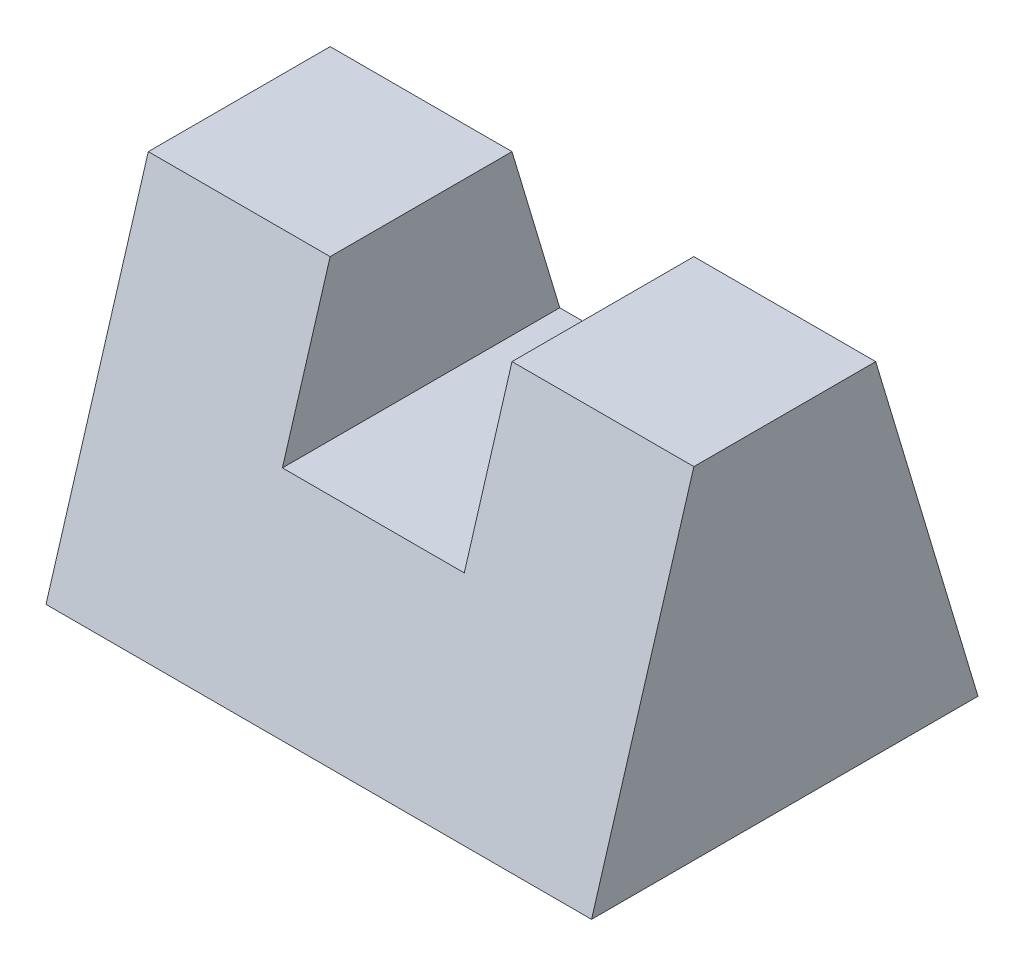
ISO-10303-21;
HEADER;
FILE_DESCRIPTION(('STEP AP214'),'2;1');
FILE_NAME('part.step','',(''),(''),'','','');
FILE_SCHEMA(('AUTOMOTIVE_DESIGN { 1 0 10303 214 1 1 1 1 }'));
ENDSEC;
DATA;
#1=APPLICATION_CONTEXT('core data for automotive mechanical design processes');
#2=APPLICATION_PROTOCOL_DEFINITION('international standard','automotive_design',2000,#1);
#3=PRODUCT_CONTEXT('',#1,'mechanical');
#4=PRODUCT('Part','Part','',(#3));
#5=PRODUCT_RELATED_PRODUCT_CATEGORY('part','',(#4));
#6=PRODUCT_DEFINITION_FORMATION('','',#4);
#7=PRODUCT_DEFINITION_CONTEXT('part definition',#1,'design');
#8=PRODUCT_DEFINITION('design','',#6,#7);
#9=PRODUCT_DEFINITION_SHAPE('','',#8);
#10=(LENGTH_UNIT() NAMED_UNIT(*) SI_UNIT(.MILLI.,.METRE.));
#11=(NAMED_UNIT(*) PLANE_ANGLE_UNIT() SI_UNIT($,.RADIAN.));
#12=(NAMED_UNIT(*) SI_UNIT($,.STERADIAN.) SOLID_ANGLE_UNIT());
#13=UNCERTAINTY_MEASURE_WITH_UNIT(LENGTH_MEASURE(1.E-05),#10,'distance_accuracy_value','');
#14=(GEOMETRIC_REPRESENTATION_CONTEXT(3) GLOBAL_UNCERTAINTY_ASSIGNED_CONTEXT((#13)) GLOBAL_UNIT_ASSIGNED_CONTEXT((#10,
#11,#12)) REPRESENTATION_CONTEXT('',''));
#15=CARTESIAN_POINT('',(0.,0.,0.));
#16=DIRECTION('',(0.,0.,1.));
#17=DIRECTION('',(1.,0.,0.));
#18=AXIS2_PLACEMENT_3D('',#15,#16,#17);
#19=CARTESIAN_POINT('',(120.,75.,-20.));
#20=DIRECTION('',(0.,-1.,0.));
#21=DIRECTION('',(0.,0.,-1.));
#22=AXIS2_PLACEMENT_3D('',#19,#20,#21);
#23=PLANE('',#22);
#24=DIRECTION('',(-1.,0.,0.));
#25=VECTOR('',#24,1.);
#26=CARTESIAN_POINT('',(120.,75.,20.));
#27=LINE('',#26,#25);
#28=CARTESIAN_POINT('',(40.,75.,20.));
#29=VERTEX_POINT('',#28);
#30=CARTESIAN_POINT('',(0.,75.,20.));
#31=VERTEX_POINT('',#30);
#32=EDGE_CURVE('E77',#29,#31,#27,.T.);
#33=ORIENTED_EDGE('',*,*,#32,.F.);
#34=DIRECTION('',(0.,0.,-1.));
#35=VECTOR('',#34,1.);
#36=CARTESIAN_POINT('',(40.,75.,-20.));
#37=LINE('',#36,#35);
#38=CARTESIAN_POINT('',(40.,75.,-20.));
#39=VERTEX_POINT('',#38);
#40=EDGE_CURVE('E39',#29,#39,#37,.T.);
#41=ORIENTED_EDGE('',*,*,#40,.T.);
#42=DIRECTION('',(-1.,0.,0.));
#43=VECTOR('',#42,1.);
#44=CARTESIAN_POINT('',(120.,75.,-20.));
#45=LINE('',#44,#43);
#46=CARTESIAN_POINT('',(0.,75.,-20.));
#47=VERTEX_POINT('',#46);
#48=EDGE_CURVE('E126',#39,#47,#45,.T.);
#49=ORIENTED_EDGE('',*,*,#48,.T.);
#50=DIRECTION('',(0.,0.,1.));
#51=VECTOR('',#50,1.);
#52=CARTESIAN_POINT('',(0.,75.,-20.));
#53=LINE('',#52,#51);
#54=EDGE_CURVE('E143',#47,#31,#53,.T.);
#55=ORIENTED_EDGE('',*,*,#54,.T.);
#56=EDGE_LOOP('',(#33,#41,#49,#55));
#57=FACE_BOUND('',#56,.T.);
#58=ADVANCED_FACE('F31',(#57),#23,.F.);
#59=CARTESIAN_POINT('',(120.,75.,20.));
#60=DIRECTION('',(0.,-0.287347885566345,-0.957826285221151));
#61=DIRECTION('',(0.,0.957826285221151,-0.287347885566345));
#62=AXIS2_PLACEMENT_3D('',#59,#60,#61);
#63=PLANE('',#62);
#64=DIRECTION('',(1.,0.,0.));
#65=VECTOR('',#64,1.);
#66=CARTESIAN_POINT('',(120.,40.,30.5));
#67=LINE('',#66,#65);
#68=CARTESIAN_POINT('',(40.,40.,30.5));
#69=VERTEX_POINT('',#68);
#70=CARTESIAN_POINT('',(80.,40.,30.5));
#71=VERTEX_POINT('',#70);
#72=EDGE_CURVE('E154',#69,#71,#67,.T.);
#73=ORIENTED_EDGE('',*,*,#72,.F.);
#74=DIRECTION('',(0.,0.957826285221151,-0.287347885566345));
#75=VECTOR('',#74,1.);
#76=CARTESIAN_POINT('',(40.,75.,20.));
#77=LINE('',#76,#75);
#78=EDGE_CURVE('E160',#69,#29,#77,.T.);
#79=ORIENTED_EDGE('',*,*,#78,.T.);
#80=ORIENTED_EDGE('',*,*,#32,.T.);
#81=DIRECTION('',(0.,-0.957826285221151,0.287347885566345));
#82=VECTOR('',#81,1.);
#83=CARTESIAN_POINT('',(0.,75.,20.));
#84=LINE('',#83,#82);
#85=CARTESIAN_POINT('',(0.,0.,42.5));
#86=VERTEX_POINT('',#85);
#87=EDGE_CURVE('E148',#31,#86,#84,.T.);
#88=ORIENTED_EDGE('',*,*,#87,.T.);
#89=DIRECTION('',(-1.,0.,0.));
#90=VECTOR('',#89,1.);
#91=CARTESIAN_POINT('',(120.,0.,42.5));
#92=LINE('',#91,#90);
#93=CARTESIAN_POINT('',(120.,0.,42.5));
#94=VERTEX_POINT('',#93);
#95=EDGE_CURVE('E112',#94,#86,#92,.T.);
#96=ORIENTED_EDGE('',*,*,#95,.F.);
#97=DIRECTION('',(0.,-0.957826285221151,0.287347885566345));
#98=VECTOR('',#97,1.);
#99=CARTESIAN_POINT('',(120.,75.,20.));
#100=LINE('',#99,#98);
#101=CARTESIAN_POINT('',(120.,75.,20.));
#102=VERTEX_POINT('',#101);
#103=EDGE_CURVE('E149',#102,#94,#100,.T.);
#104=ORIENTED_EDGE('',*,*,#103,.F.);
#105=CARTESIAN_POINT('',(80.,75.,20.));
#106=VERTEX_POINT('',#105);
#107=EDGE_CURVE('E130',#102,#106,#27,.T.);
#108=ORIENTED_EDGE('',*,*,#107,.T.);
#109=DIRECTION('',(0.,-0.957826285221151,0.287347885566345));
#110=VECTOR('',#109,1.);
#111=CARTESIAN_POINT('',(80.,75.,20.));
#112=LINE('',#111,#110);
#113=EDGE_CURVE('E46',#106,#71,#112,.T.);
#114=ORIENTED_EDGE('',*,*,#113,.T.);
#115=EDGE_LOOP('',(#73,#79,#80,#88,#96,#104,#108,#114));
#116=FACE_BOUND('',#115,.T.);
#117=ADVANCED_FACE('F33',(#116),#63,.F.);
#118=CARTESIAN_POINT('',(120.,0.,42.5));
#119=DIRECTION('',(0.,1.,0.));
#120=DIRECTION('',(0.,0.,1.));
#121=AXIS2_PLACEMENT_3D('',#118,#119,#120);
#122=PLANE('',#121);
#123=DIRECTION('',(0.,0.,-1.));
#124=VECTOR('',#123,1.);
#125=CARTESIAN_POINT('',(0.,0.,42.5));
#126=LINE('',#125,#124);
#127=CARTESIAN_POINT('',(0.,0.,-42.5));
#128=VERTEX_POINT('',#127);
#129=EDGE_CURVE('E144',#86,#128,#126,.T.);
#130=ORIENTED_EDGE('',*,*,#129,.T.);
#131=DIRECTION('',(-1.,0.,0.));
#132=VECTOR('',#131,1.);
#133=CARTESIAN_POINT('',(120.,0.,-42.5));
#134=LINE('',#133,#132);
#135=CARTESIAN_POINT('',(120.,0.,-42.5));
#136=VERTEX_POINT('',#135);
#137=EDGE_CURVE('E125',#136,#128,#134,.T.);
#138=ORIENTED_EDGE('',*,*,#137,.F.);
#139=DIRECTION('',(0.,0.,-1.));
#140=VECTOR('',#139,1.);
#141=CARTESIAN_POINT('',(120.,0.,42.5));
#142=LINE('',#141,#140);
#143=EDGE_CURVE('E85',#94,#136,#142,.T.);
#144=ORIENTED_EDGE('',*,*,#143,.F.);
#145=ORIENTED_EDGE('',*,*,#95,.T.);
#146=EDGE_LOOP('',(#130,#138,#144,#145));
#147=FACE_BOUND('',#146,.T.);
#148=ADVANCED_FACE('F174',(#147),#122,.F.);
#149=CARTESIAN_POINT('',(120.,0.,-42.5));
#150=DIRECTION('',(0.,-0.287347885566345,0.957826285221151));
#151=DIRECTION('',(0.,-0.957826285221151,-0.287347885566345));
#152=AXIS2_PLACEMENT_3D('',#149,#150,#151);
#153=PLANE('',#152);
#154=ORIENTED_EDGE('',*,*,#48,.F.);
#155=DIRECTION('',(0.,-0.957826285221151,-0.287347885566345));
#156=VECTOR('',#155,1.);
#157=CARTESIAN_POINT('',(40.,0.,-42.5));
#158=LINE('',#157,#156);
#159=CARTESIAN_POINT('',(40.,40.,-30.5));
#160=VERTEX_POINT('',#159);
#161=EDGE_CURVE('E138',#39,#160,#158,.T.);
#162=ORIENTED_EDGE('',*,*,#161,.T.);
#163=DIRECTION('',(-1.,0.,0.));
#164=VECTOR('',#163,1.);
#165=CARTESIAN_POINT('',(120.,40.,-30.5));
#166=LINE('',#165,#164);
#167=CARTESIAN_POINT('',(80.,40.,-30.5));
#168=VERTEX_POINT('',#167);
#169=EDGE_CURVE('E11',#168,#160,#166,.T.);
#170=ORIENTED_EDGE('',*,*,#169,.F.);
#171=DIRECTION('',(0.,0.957826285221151,0.287347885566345));
#172=VECTOR('',#171,1.);
#173=CARTESIAN_POINT('',(80.,0.,-42.5));
#174=LINE('',#173,#172);
#175=CARTESIAN_POINT('',(80.,75.,-20.));
#176=VERTEX_POINT('',#175);
#177=EDGE_CURVE('E107',#168,#176,#174,.T.);
#178=ORIENTED_EDGE('',*,*,#177,.T.);
#179=CARTESIAN_POINT('',(120.,75.,-20.));
#180=VERTEX_POINT('',#179);
#181=EDGE_CURVE('E120',#180,#176,#45,.T.);
#182=ORIENTED_EDGE('',*,*,#181,.F.);
#183=DIRECTION('',(0.,0.957826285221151,0.287347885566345));
#184=VECTOR('',#183,1.);
#185=CARTESIAN_POINT('',(120.,0.,-42.5));
#186=LINE('',#185,#184);
#187=EDGE_CURVE('E156',#136,#180,#186,.T.);
#188=ORIENTED_EDGE('',*,*,#187,.F.);
#189=ORIENTED_EDGE('',*,*,#137,.T.);
#190=DIRECTION('',(0.,0.957826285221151,0.287347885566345));
#191=VECTOR('',#190,1.);
#192=CARTESIAN_POINT('',(0.,0.,-42.5));
#193=LINE('',#192,#191);
#194=EDGE_CURVE('E140',#128,#47,#193,.T.);
#195=ORIENTED_EDGE('',*,*,#194,.T.);
#196=EDGE_LOOP('',(#154,#162,#170,#178,#182,#188,#189,#195));
#197=FACE_BOUND('',#196,.T.);
#198=ADVANCED_FACE('F118',(#197),#153,.F.);
#199=ORIENTED_EDGE('',*,*,#181,.T.);
#200=DIRECTION('',(0.,0.,1.));
#201=VECTOR('',#200,1.);
#202=CARTESIAN_POINT('',(80.,75.,-20.));
#203=LINE('',#202,#201);
#204=EDGE_CURVE('E104',#176,#106,#203,.T.);
#205=ORIENTED_EDGE('',*,*,#204,.T.);
#206=ORIENTED_EDGE('',*,*,#107,.F.);
#207=DIRECTION('',(0.,0.,1.));
#208=VECTOR('',#207,1.);
#209=CARTESIAN_POINT('',(120.,75.,-20.));
#210=LINE('',#209,#208);
#211=EDGE_CURVE('E55',#180,#102,#210,.T.);
#212=ORIENTED_EDGE('',*,*,#211,.F.);
#213=EDGE_LOOP('',(#199,#205,#206,#212));
#214=FACE_BOUND('',#213,.T.);
#215=ADVANCED_FACE('F124',(#214),#23,.F.);
#216=CARTESIAN_POINT('',(120.,0.,42.5));
#217=DIRECTION('',(1.,0.,0.));
#218=DIRECTION('',(0.,0.,-1.));
#219=AXIS2_PLACEMENT_3D('',#216,#217,#218);
#220=PLANE('',#219);
#221=ORIENTED_EDGE('',*,*,#103,.T.);
#222=ORIENTED_EDGE('',*,*,#143,.T.);
#223=ORIENTED_EDGE('',*,*,#187,.T.);
#224=ORIENTED_EDGE('',*,*,#211,.T.);
#225=EDGE_LOOP('',(#221,#222,#223,#224));
#226=FACE_BOUND('',#225,.T.);
#227=ADVANCED_FACE('F173',(#226),#220,.T.);
#228=CARTESIAN_POINT('',(0.,0.,42.5));
#229=DIRECTION('',(1.,0.,0.));
#230=DIRECTION('',(0.,0.,-1.));
#231=AXIS2_PLACEMENT_3D('',#228,#229,#230);
#232=PLANE('',#231);
#233=ORIENTED_EDGE('',*,*,#87,.F.);
#234=ORIENTED_EDGE('',*,*,#54,.F.);
#235=ORIENTED_EDGE('',*,*,#194,.F.);
#236=ORIENTED_EDGE('',*,*,#129,.F.);
#237=EDGE_LOOP('',(#233,#234,#235,#236));
#238=FACE_BOUND('',#237,.T.);
#239=ADVANCED_FACE('F147',(#238),#232,.F.);
#240=CARTESIAN_POINT('',(40.,40.,39.8467432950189));
#241=DIRECTION('',(0.,1.,0.));
#242=DIRECTION('',(0.,0.,1.));
#243=AXIS2_PLACEMENT_3D('',#240,#241,#242);
#244=PLANE('',#243);
#245=ORIENTED_EDGE('',*,*,#72,.T.);
#246=DIRECTION('',(0.,0.,-1.));
#247=VECTOR('',#246,1.);
#248=CARTESIAN_POINT('',(80.,40.,-36.9731800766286));
#249=LINE('',#248,#247);
#250=EDGE_CURVE('E122',#71,#168,#249,.T.);
#251=ORIENTED_EDGE('',*,*,#250,.T.);
#252=ORIENTED_EDGE('',*,*,#169,.T.);
#253=DIRECTION('',(0.,0.,1.));
#254=VECTOR('',#253,1.);
#255=CARTESIAN_POINT('',(40.,40.,-36.9731800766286));
#256=LINE('',#255,#254);
#257=EDGE_CURVE('E165',#160,#69,#256,.T.);
#258=ORIENTED_EDGE('',*,*,#257,.T.);
#259=EDGE_LOOP('',(#245,#251,#252,#258));
#260=FACE_BOUND('',#259,.T.);
#261=ADVANCED_FACE('F170',(#260),#244,.T.);
#262=CARTESIAN_POINT('',(40.,40.,-36.9731800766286));
#263=DIRECTION('',(-1.,0.,0.));
#264=DIRECTION('',(0.,0.,1.));
#265=AXIS2_PLACEMENT_3D('',#262,#263,#264);
#266=PLANE('',#265);
#267=ORIENTED_EDGE('',*,*,#257,.F.);
#268=ORIENTED_EDGE('',*,*,#161,.F.);
#269=ORIENTED_EDGE('',*,*,#40,.F.);
#270=ORIENTED_EDGE('',*,*,#78,.F.);
#271=EDGE_LOOP('',(#267,#268,#269,#270));
#272=FACE_BOUND('',#271,.T.);
#273=ADVANCED_FACE('F195',(#272),#266,.F.);
#274=CARTESIAN_POINT('',(80.,40.,-36.9731800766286));
#275=DIRECTION('',(1.,0.,0.));
#276=DIRECTION('',(0.,0.,-1.));
#277=AXIS2_PLACEMENT_3D('',#274,#275,#276);
#278=PLANE('',#277);
#279=ORIENTED_EDGE('',*,*,#204,.F.);
#280=ORIENTED_EDGE('',*,*,#177,.F.);
#281=ORIENTED_EDGE('',*,*,#250,.F.);
#282=ORIENTED_EDGE('',*,*,#113,.F.);
#283=EDGE_LOOP('',(#279,#280,#281,#282));
#284=FACE_BOUND('',#283,.T.);
#285=ADVANCED_FACE('F106',(#284),#278,.F.);
#286=CLOSED_SHELL('',(#58,#117,#148,#198,#215,#227,#239,#261,#273,#285));
#287=MANIFOLD_SOLID_BREP('B2',#286);
#288=ADVANCED_BREP_SHAPE_REPRESENTATION('',(#18,#287),#14);
#289=SHAPE_DEFINITION_REPRESENTATION(#9,#288);
ENDSEC;
END-ISO-10303-21;
